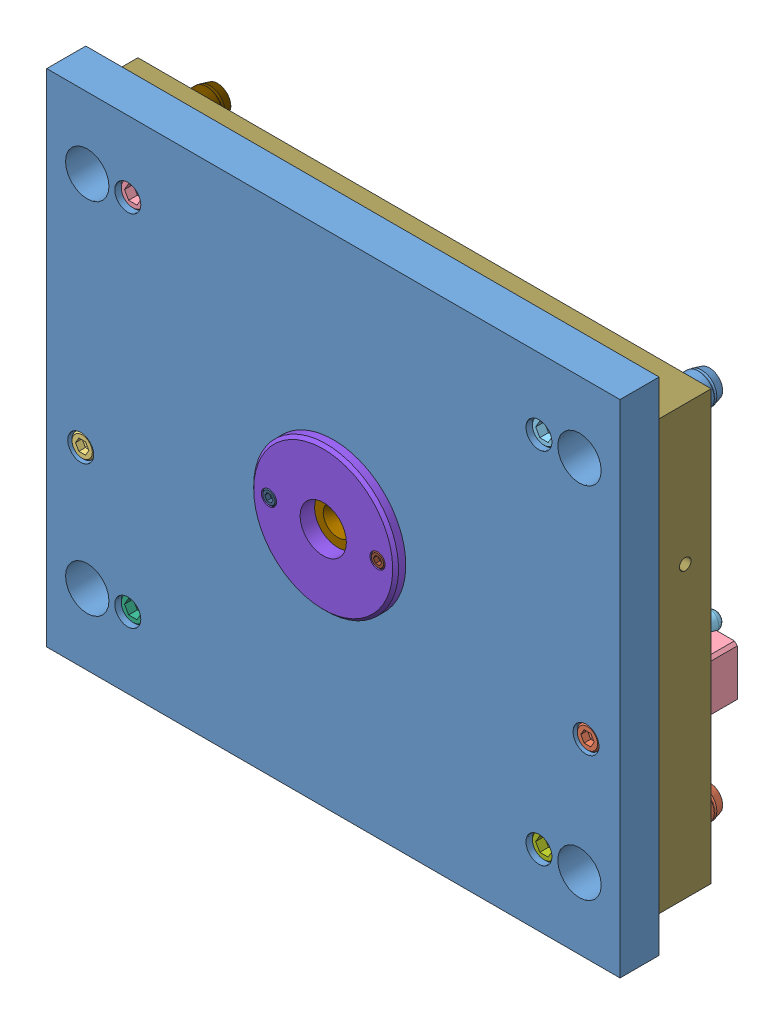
SolidWorks assembly Partie Fixe.sldasm, configuration Défaut (file format 4700). Lengths in mm.
Overall size (396 346 125.8).
25 component instances, 23 part files, 10 mates.
Components (placement in the parent):
- moule machoire.sldasm-Part-109-1: moule machoire.sldasm-Part-109.sldprt [Défaut] at origin size (396 346 27)
- moule machoire.sldasm-Part-12-1: moule machoire.sldasm-Part-12.sldprt [Défaut] at origin size (16 16 45)
- moule machoire.sldasm-Part-27-1: moule machoire.sldasm-Part-27.sldprt [Défaut] at origin size (16 16 45)
- moule machoire.sldasm-Part-117-1: moule machoire.sldasm-Part-117.sldprt [Défaut] at origin size (18 18 42)
- moule machoire.sldasm-Part-118-1: moule machoire.sldasm-Part-118.sldprt [Défaut] at origin size (18 18 42)
- moule machoire.sldasm-Part-119-1: moule machoire.sldasm-Part-119.sldprt [Défaut] at origin size (18 18 42)
- moule machoire.sldasm-Part-120-1: moule machoire.sldasm-Part-120.sldprt [Défaut] at origin size (18 18 42)
- moule machoire.sldasm-Part-30-1: moule machoire.sldasm-Part-30.sldprt [Défaut] at origin size (100 100 10)
- moule machoire.sldasm-Part-31-1: moule machoire.sldasm-Part-31.sldprt [Défaut] at origin size (40 40 60)
- moule machoire.sldasm-Part-131-1: moule machoire.sldasm-Part-131.sldprt [Défaut] at origin size (10 10 16)
- moule machoire.sldasm-Part-132-1: moule machoire.sldasm-Part-132.sldprt [Défaut] at origin size (10 10 16)
- moule machoire.sldasm-Part-43-1: moule machoire.sldasm-Part-43.sldprt [Défaut] at origin size (396 296 36)
- moule machoire.sldasm-Part-204-1: moule machoire.sldasm-Part-204.sldprt [Défaut] at origin size (120 4 30)
- moule machoire.sldasm-Part-205-1: moule machoire.sldasm-Part-205.sldprt [Défaut] at origin size (7 24 7)
- moule machoire.sldasm-Part-206-1: moule machoire.sldasm-Part-206.sldprt [Défaut] at origin size (7 24 7)
- moule machoire.sldasm-Part-207-1: moule machoire.sldasm-Part-207.sldprt [Défaut] at origin size (7 24 7)
- moule machoire.sldasm-Part-208-1: moule machoire.sldasm-Part-208.sldprt [Défaut] at origin size (7 24 7)
- moule machoire.sldasm-Part-115-1: moule machoire.sldasm-Part-115.sldprt [Défaut] at origin size (35 35 68.47)
- moule machoire.sldasm-Part-128-1: moule machoire.sldasm-Part-128.sldprt [Défaut] at origin size (35 35 68.47)
- moule machoire.sldasm-Part-129-1: moule machoire.sldasm-Part-129.sldprt [Défaut] at origin size (35 35 68.47)
- moule machoire.sldasm-Part-130-1: moule machoire.sldasm-Part-130.sldprt [Défaut] at origin size (35 35 68.47)
- moule machoire.sldasm-Part-153-2: moule machoire.sldasm-Part-153.sldprt [Défaut] at origin size (25 36 65)
- moule machoire.sldasm-Part-16-2: moule machoire.sldasm-Part-16.sldprt [Défaut] at origin size (30.35 18 91.8)
- moule machoire.sldasm-Part-153-3: moule machoire.sldasm-Part-153.sldprt [Défaut] at (0 -83.7 0) x (-1 0 0) z (0 0 1) size (25 36 65)
- moule machoire.sldasm-Part-16-3: moule machoire.sldasm-Part-16.sldprt [Défaut] at (0 -83.7 0) x (-1 0 0) z (0 0 1) size (30.35 18 91.8)
Mates (geometry in assembly coordinates):
- Coaxiale1: concentric anti-aligned: cylinder of moule machoire.sldasm-Part-27-1 through (-174.5 -41.85 -8) axis (0 0 1) radius 5; cylinder of moule machoire.sldasm-Part-153-2 through (-174.5 -41.85 36) axis (0 0 -1) radius 4.25
- Coïncidente1: coincident aligned: plane of moule machoire.sldasm-Part-43-1 through (170 124 36) normal (0 0 1); plane of moule machoire.sldasm-Part-153-2 through (-162 -23.85 36) normal (0 0 1)
- Coïncidente2: coincident anti-aligned: plane of moule machoire.sldasm-Part-43-1 through (-187 -59.85 -29) normal (0 1 0); plane of moule machoire.sldasm-Part-153-2 through (-187 -59.85 -29) normal (0 -1 0)
- Coaxiale2: concentric aligned: cylinder of moule machoire.sldasm-Part-43-1 through (-130.3594 -41.85 42.924) axis (-0.173648 0 -0.984808) radius 7; cylinder of moule machoire.sldasm-Part-16-2 through (-130.3594 -41.85 42.924) axis (-0.173648 0 -0.984808) radius 7
- Coïncidente3: coincident aligned: plane of moule machoire.sldasm-Part-43-1 through (170 124 36) normal (0 0 1); plane of moule machoire.sldasm-Part-16-2 through (-149.0814 -70.4596 36) normal (0 0 1)
- Coaxiale3: concentric anti-aligned: cylinder of moule machoire.sldasm-Part-12-1 through (174.5 -41.85 -8) axis (0 0 1) radius 5; cylinder of moule machoire.sldasm-Part-153-3 through (174.5 -41.85 36) axis (0 0 -1) radius 4.25
- Coïncidente4: coincident aligned: plane of moule machoire.sldasm-Part-43-1 through (170 124 36) normal (0 0 1); plane of moule machoire.sldasm-Part-153-3 through (162 -59.85 36) normal (0 0 1)
- Coïncidente5: coincident anti-aligned: plane of moule machoire.sldasm-Part-43-1 through (187 -23.85 -29) normal (0 -1 0); plane of moule machoire.sldasm-Part-153-3
- Coaxiale4: concentric aligned: cylinder of moule machoire.sldasm-Part-43-1 through (130.3594 -41.85 42.924) axis (0.173648 0 -0.984808) radius 7; cylinder of moule machoire.sldasm-Part-16-3 through (130.3594 -41.85 42.924) axis (0.173648 0 -0.984808) radius 7
- Coïncidente6: coincident aligned: plane of moule machoire.sldasm-Part-43-1 through (170 124 36) normal (0 0 1); plane of moule machoire.sldasm-Part-16-3 through (149.0814 -13.2404 36) normal (0 0 1)
